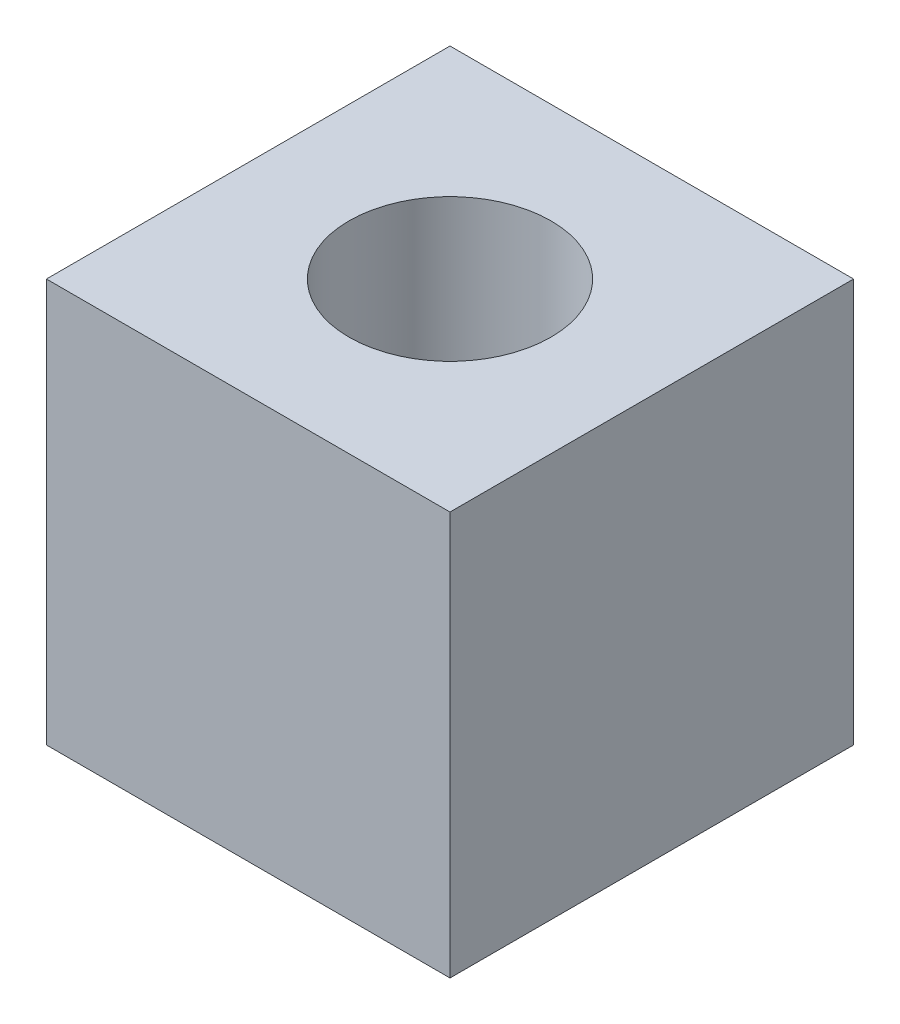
from build123d import *

# Parameters (mm, degrees)
SKETCH1_W          = 101.6
SKETCH1_H          = 101.6
EXTRUDE1_DEPTH     = 101.6
SKETCH2_R          = 25.4
CUT_EXTRUDE1_DEPTH = 176.976362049


with BuildPart() as part:
    # Sketch1 → Extrude1 (new body)
    with BuildSketch(Plane.XY):
        with Locations((50.8, 50.8)):
            Rectangle(SKETCH1_W, SKETCH1_H)
    extrude(amount=EXTRUDE1_DEPTH)

    # Sketch2 → Cut-Extrude1 (cut, through all)
    with BuildSketch(Plane(origin=(0, 101.6, 0), x_dir=(-1, 0, 0), z_dir=(0, 1, 0))):
        with Locations(Location((-50.8, 50.8, 0), (0, 0, 90))):
            Circle(SKETCH2_R)
    extrude(amount=-CUT_EXTRUDE1_DEPTH, mode=Mode.SUBTRACT)


solid = part.part
